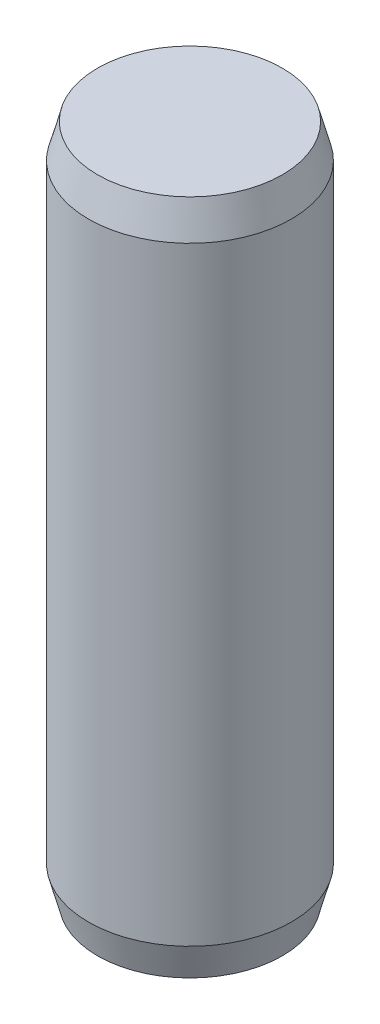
from build123d import *


with BuildPart() as part:
    # Esquisse1 → Base-R_volution (revolve)
    with BuildSketch(Plane.XY, mode=Mode.PRIVATE) as base_r_volution_sk:
        Polygon((1.5, -9.5), (1.5, -0.5), (1.366025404, 0), (0, 0), (0, -10), (1.366025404, -10), align=None)
    revolve(base_r_volution_sk.sketch.rotate(Axis((0, 0, 0), (0, -1, 0)), 90), axis=Axis((0, 0, 0), (0, -1, 0)))


solid = part.part
